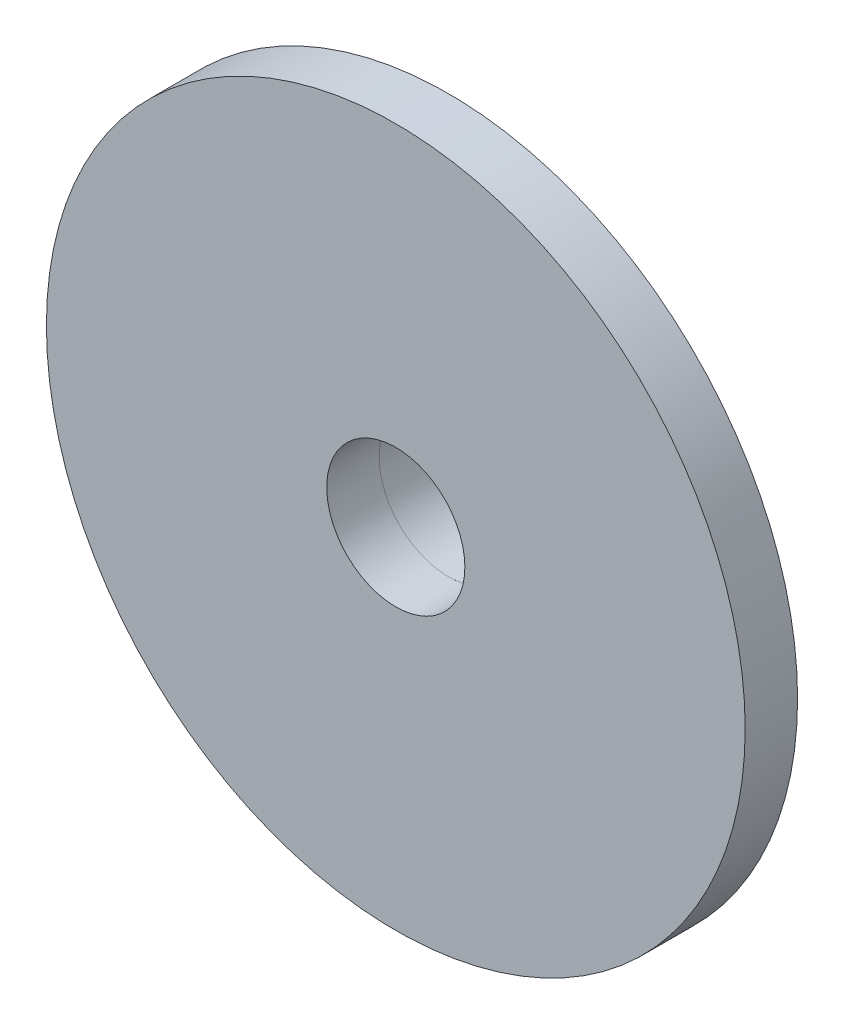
ISO-10303-21;
HEADER;
FILE_DESCRIPTION(('STEP AP214'),'2;1');
FILE_NAME('part.step','',(''),(''),'','','');
FILE_SCHEMA(('AUTOMOTIVE_DESIGN { 1 0 10303 214 1 1 1 1 }'));
ENDSEC;
DATA;
#1=APPLICATION_CONTEXT('core data for automotive mechanical design processes');
#2=APPLICATION_PROTOCOL_DEFINITION('international standard','automotive_design',2000,#1);
#3=PRODUCT_CONTEXT('',#1,'mechanical');
#4=PRODUCT('Part','Part','',(#3));
#5=PRODUCT_RELATED_PRODUCT_CATEGORY('part','',(#4));
#6=PRODUCT_DEFINITION_FORMATION('','',#4);
#7=PRODUCT_DEFINITION_CONTEXT('part definition',#1,'design');
#8=PRODUCT_DEFINITION('design','',#6,#7);
#9=PRODUCT_DEFINITION_SHAPE('','',#8);
#10=(LENGTH_UNIT() NAMED_UNIT(*) SI_UNIT(.MILLI.,.METRE.));
#11=(NAMED_UNIT(*) PLANE_ANGLE_UNIT() SI_UNIT($,.RADIAN.));
#12=(NAMED_UNIT(*) SI_UNIT($,.STERADIAN.) SOLID_ANGLE_UNIT());
#13=UNCERTAINTY_MEASURE_WITH_UNIT(LENGTH_MEASURE(1.E-05),#10,'distance_accuracy_value','');
#14=(GEOMETRIC_REPRESENTATION_CONTEXT(3) GLOBAL_UNCERTAINTY_ASSIGNED_CONTEXT((#13)) GLOBAL_UNIT_ASSIGNED_CONTEXT((#10,
#11,#12)) REPRESENTATION_CONTEXT('',''));
#15=CARTESIAN_POINT('',(0.,0.,0.));
#16=DIRECTION('',(0.,0.,1.));
#17=DIRECTION('',(1.,0.,0.));
#18=AXIS2_PLACEMENT_3D('',#15,#16,#17);
#19=CARTESIAN_POINT('',(0.,0.,0.));
#20=DIRECTION('',(0.,0.,1.));
#21=DIRECTION('',(1.,0.,0.));
#22=AXIS2_PLACEMENT_3D('',#19,#20,#21);
#23=PLANE('',#22);
#24=CARTESIAN_POINT('',(0.,0.,0.));
#25=DIRECTION('',(0.,0.,1.));
#26=DIRECTION('',(1.,0.,0.));
#27=AXIS2_PLACEMENT_3D('',#24,#25,#26);
#28=CIRCLE('',#27,6.5);
#29=CARTESIAN_POINT('',(6.5,0.,0.));
#30=VERTEX_POINT('',#29);
#31=EDGE_CURVE('E32',#30,#30,#28,.T.);
#32=ORIENTED_EDGE('',*,*,#31,.F.);
#33=EDGE_LOOP('',(#32));
#34=FACE_BOUND('',#33,.T.);
#35=CARTESIAN_POINT('',(0.,0.,0.));
#36=DIRECTION('',(0.,0.,1.));
#37=DIRECTION('',(1.,0.,0.));
#38=AXIS2_PLACEMENT_3D('',#35,#36,#37);
#39=CIRCLE('',#38,2.);
#40=CARTESIAN_POINT('',(2.,0.,0.));
#41=VERTEX_POINT('',#40);
#42=EDGE_CURVE('E36',#41,#41,#39,.T.);
#43=ORIENTED_EDGE('',*,*,#42,.T.);
#44=EDGE_LOOP('',(#43));
#45=FACE_BOUND('',#44,.T.);
#46=ADVANCED_FACE('F25',(#34,#45),#23,.F.);
#47=CARTESIAN_POINT('',(0.,0.,1.5));
#48=DIRECTION('',(0.,0.,-1.));
#49=DIRECTION('',(-1.,0.,0.));
#50=AXIS2_PLACEMENT_3D('',#47,#48,#49);
#51=CYLINDRICAL_SURFACE('',#50,6.5);
#52=CARTESIAN_POINT('',(0.,0.,1.5));
#53=DIRECTION('',(0.,0.,1.));
#54=DIRECTION('',(1.,0.,0.));
#55=AXIS2_PLACEMENT_3D('',#52,#53,#54);
#56=CIRCLE('',#55,6.5);
#57=CARTESIAN_POINT('',(6.5,0.,1.5));
#58=VERTEX_POINT('',#57);
#59=EDGE_CURVE('E10',#58,#58,#56,.T.);
#60=ORIENTED_EDGE('',*,*,#59,.F.);
#61=EDGE_LOOP('',(#60));
#62=FACE_BOUND('',#61,.T.);
#63=ORIENTED_EDGE('',*,*,#31,.T.);
#64=EDGE_LOOP('',(#63));
#65=FACE_BOUND('',#64,.T.);
#66=ADVANCED_FACE('F27',(#62,#65),#51,.T.);
#67=CARTESIAN_POINT('',(0.,0.,1.5));
#68=DIRECTION('',(0.,0.,-1.));
#69=DIRECTION('',(-1.,0.,0.));
#70=AXIS2_PLACEMENT_3D('',#67,#68,#69);
#71=CYLINDRICAL_SURFACE('',#70,2.);
#72=CARTESIAN_POINT('',(0.,0.,1.5));
#73=DIRECTION('',(0.,0.,1.));
#74=DIRECTION('',(1.,0.,0.));
#75=AXIS2_PLACEMENT_3D('',#72,#73,#74);
#76=CIRCLE('',#75,2.);
#77=CARTESIAN_POINT('',(2.,0.,1.5));
#78=VERTEX_POINT('',#77);
#79=EDGE_CURVE('E40',#78,#78,#76,.T.);
#80=ORIENTED_EDGE('',*,*,#79,.T.);
#81=EDGE_LOOP('',(#80));
#82=FACE_BOUND('',#81,.T.);
#83=ORIENTED_EDGE('',*,*,#42,.F.);
#84=EDGE_LOOP('',(#83));
#85=FACE_BOUND('',#84,.T.);
#86=ADVANCED_FACE('F76',(#82,#85),#71,.F.);
#87=CARTESIAN_POINT('',(0.,0.,1.5));
#88=DIRECTION('',(0.,0.,1.));
#89=DIRECTION('',(1.,0.,0.));
#90=AXIS2_PLACEMENT_3D('',#87,#88,#89);
#91=PLANE('',#90);
#92=CARTESIAN_POINT('',(0.,0.,1.5));
#93=DIRECTION('',(0.,0.,1.));
#94=DIRECTION('',(1.,0.,0.));
#95=AXIS2_PLACEMENT_3D('',#92,#93,#94);
#96=CIRCLE('',#95,10.);
#97=CARTESIAN_POINT('',(10.,0.,1.5));
#98=VERTEX_POINT('',#97);
#99=EDGE_CURVE('E48',#98,#98,#96,.T.);
#100=ORIENTED_EDGE('',*,*,#99,.F.);
#101=EDGE_LOOP('',(#100));
#102=FACE_BOUND('',#101,.T.);
#103=ORIENTED_EDGE('',*,*,#59,.T.);
#104=EDGE_LOOP('',(#103));
#105=FACE_BOUND('',#104,.T.);
#106=ADVANCED_FACE('F81',(#102,#105),#91,.F.);
#107=CARTESIAN_POINT('',(0.,0.,3.));
#108=DIRECTION('',(0.,0.,1.));
#109=DIRECTION('',(1.,0.,0.));
#110=AXIS2_PLACEMENT_3D('',#107,#108,#109);
#111=PLANE('',#110);
#112=CARTESIAN_POINT('',(0.,0.,3.));
#113=DIRECTION('',(0.,0.,1.));
#114=DIRECTION('',(1.,0.,0.));
#115=AXIS2_PLACEMENT_3D('',#112,#113,#114);
#116=CIRCLE('',#115,10.);
#117=CARTESIAN_POINT('',(10.,0.,3.));
#118=VERTEX_POINT('',#117);
#119=EDGE_CURVE('E45',#118,#118,#116,.T.);
#120=ORIENTED_EDGE('',*,*,#119,.T.);
#121=EDGE_LOOP('',(#120));
#122=FACE_BOUND('',#121,.T.);
#123=CARTESIAN_POINT('',(0.,0.,3.));
#124=DIRECTION('',(0.,0.,1.));
#125=DIRECTION('',(1.,0.,0.));
#126=AXIS2_PLACEMENT_3D('',#123,#124,#125);
#127=CIRCLE('',#126,1.97698016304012);
#128=CARTESIAN_POINT('',(1.97698016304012,0.,3.));
#129=VERTEX_POINT('',#128);
#130=EDGE_CURVE('E51',#129,#129,#127,.T.);
#131=ORIENTED_EDGE('',*,*,#130,.F.);
#132=EDGE_LOOP('',(#131));
#133=FACE_BOUND('',#132,.T.);
#134=ADVANCED_FACE('F84',(#122,#133),#111,.T.);
#135=ORIENTED_EDGE('',*,*,#79,.F.);
#136=EDGE_LOOP('',(#135));
#137=FACE_BOUND('',#136,.T.);
#138=CARTESIAN_POINT('',(0.,0.,1.5));
#139=DIRECTION('',(0.,0.,1.));
#140=DIRECTION('',(1.,0.,0.));
#141=AXIS2_PLACEMENT_3D('',#138,#139,#140);
#142=CIRCLE('',#141,1.97698016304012);
#143=CARTESIAN_POINT('',(1.97698016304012,0.,1.5));
#144=VERTEX_POINT('',#143);
#145=EDGE_CURVE('E54',#144,#144,#142,.T.);
#146=ORIENTED_EDGE('',*,*,#145,.T.);
#147=EDGE_LOOP('',(#146));
#148=FACE_BOUND('',#147,.T.);
#149=ADVANCED_FACE('F58',(#137,#148),#91,.F.);
#150=CARTESIAN_POINT('',(0.,0.,3.));
#151=DIRECTION('',(0.,0.,-1.));
#152=DIRECTION('',(-1.,0.,0.));
#153=AXIS2_PLACEMENT_3D('',#150,#151,#152);
#154=CYLINDRICAL_SURFACE('',#153,10.);
#155=ORIENTED_EDGE('',*,*,#119,.F.);
#156=EDGE_LOOP('',(#155));
#157=FACE_BOUND('',#156,.T.);
#158=ORIENTED_EDGE('',*,*,#99,.T.);
#159=EDGE_LOOP('',(#158));
#160=FACE_BOUND('',#159,.T.);
#161=ADVANCED_FACE('F62',(#157,#160),#154,.T.);
#162=CARTESIAN_POINT('',(0.,0.,3.));
#163=DIRECTION('',(0.,0.,-1.));
#164=DIRECTION('',(-1.,0.,0.));
#165=AXIS2_PLACEMENT_3D('',#162,#163,#164);
#166=CYLINDRICAL_SURFACE('',#165,1.97698016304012);
#167=ORIENTED_EDGE('',*,*,#130,.T.);
#168=EDGE_LOOP('',(#167));
#169=FACE_BOUND('',#168,.T.);
#170=ORIENTED_EDGE('',*,*,#145,.F.);
#171=EDGE_LOOP('',(#170));
#172=FACE_BOUND('',#171,.T.);
#173=ADVANCED_FACE('F60',(#169,#172),#166,.F.);
#174=CLOSED_SHELL('',(#46,#66,#86,#106,#134,#149,#161,#173));
#175=MANIFOLD_SOLID_BREP('B2',#174);
#176=ADVANCED_BREP_SHAPE_REPRESENTATION('',(#18,#175),#14);
#177=SHAPE_DEFINITION_REPRESENTATION(#9,#176);
ENDSEC;
END-ISO-10303-21;
